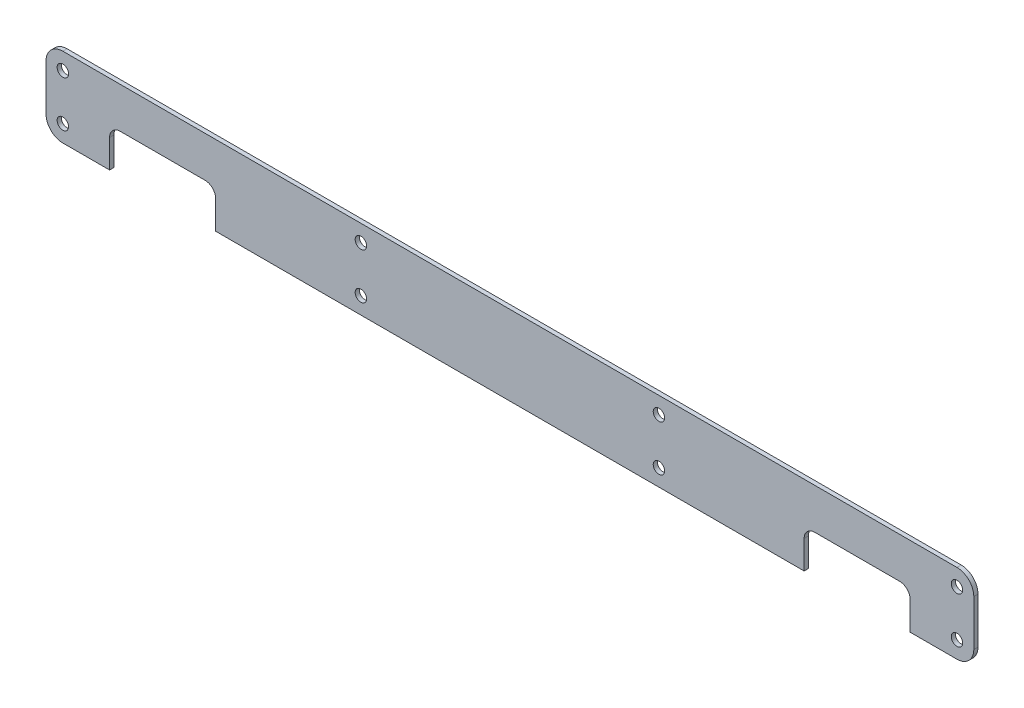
ISO-10303-21;
HEADER;
FILE_DESCRIPTION(('STEP AP214'),'2;1');
FILE_NAME('part.step','',(''),(''),'','','');
FILE_SCHEMA(('AUTOMOTIVE_DESIGN { 1 0 10303 214 1 1 1 1 }'));
ENDSEC;
DATA;
#1=APPLICATION_CONTEXT('core data for automotive mechanical design processes');
#2=APPLICATION_PROTOCOL_DEFINITION('international standard','automotive_design',2000,#1);
#3=PRODUCT_CONTEXT('',#1,'mechanical');
#4=PRODUCT('Part','Part','',(#3));
#5=PRODUCT_RELATED_PRODUCT_CATEGORY('part','',(#4));
#6=PRODUCT_DEFINITION_FORMATION('','',#4);
#7=PRODUCT_DEFINITION_CONTEXT('part definition',#1,'design');
#8=PRODUCT_DEFINITION('design','',#6,#7);
#9=PRODUCT_DEFINITION_SHAPE('','',#8);
#10=(LENGTH_UNIT() NAMED_UNIT(*) SI_UNIT(.MILLI.,.METRE.));
#11=(NAMED_UNIT(*) PLANE_ANGLE_UNIT() SI_UNIT($,.RADIAN.));
#12=(NAMED_UNIT(*) SI_UNIT($,.STERADIAN.) SOLID_ANGLE_UNIT());
#13=UNCERTAINTY_MEASURE_WITH_UNIT(LENGTH_MEASURE(1.E-05),#10,'distance_accuracy_value','');
#14=(GEOMETRIC_REPRESENTATION_CONTEXT(3) GLOBAL_UNCERTAINTY_ASSIGNED_CONTEXT((#13)) GLOBAL_UNIT_ASSIGNED_CONTEXT((#10,
#11,#12)) REPRESENTATION_CONTEXT('',''));
#15=CARTESIAN_POINT('',(0.,0.,0.));
#16=DIRECTION('',(0.,0.,1.));
#17=DIRECTION('',(1.,0.,0.));
#18=AXIS2_PLACEMENT_3D('',#15,#16,#17);
#19=CARTESIAN_POINT('',(0.,0.,-1.5875));
#20=DIRECTION('',(0.,0.,1.));
#21=DIRECTION('',(1.,0.,0.));
#22=AXIS2_PLACEMENT_3D('',#19,#20,#21);
#23=PLANE('',#22);
#24=CARTESIAN_POINT('',(56.2166666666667,23.65,-1.5875));
#25=DIRECTION('',(0.,0.,-1.));
#26=DIRECTION('',(-1.,0.,0.));
#27=AXIS2_PLACEMENT_3D('',#24,#25,#26);
#28=CIRCLE('',#27,2.15);
#29=CARTESIAN_POINT('',(54.0666666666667,23.65,-1.5875));
#30=VERTEX_POINT('',#29);
#31=EDGE_CURVE('E407',#30,#30,#28,.T.);
#32=ORIENTED_EDGE('',*,*,#31,.F.);
#33=EDGE_LOOP('',(#32));
#34=FACE_BOUND('',#33,.T.);
#35=CARTESIAN_POINT('',(-56.2166666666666,23.65,-1.5875));
#36=DIRECTION('',(0.,0.,-1.));
#37=DIRECTION('',(-1.,0.,0.));
#38=AXIS2_PLACEMENT_3D('',#35,#36,#37);
#39=CIRCLE('',#38,2.15);
#40=CARTESIAN_POINT('',(-58.3666666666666,23.65,-1.5875));
#41=VERTEX_POINT('',#40);
#42=EDGE_CURVE('E413',#41,#41,#39,.T.);
#43=ORIENTED_EDGE('',*,*,#42,.F.);
#44=EDGE_LOOP('',(#43));
#45=FACE_BOUND('',#44,.T.);
#46=CARTESIAN_POINT('',(-168.65,23.65,-1.5875));
#47=DIRECTION('',(0.,0.,-1.));
#48=DIRECTION('',(-1.,0.,0.));
#49=AXIS2_PLACEMENT_3D('',#46,#47,#48);
#50=CIRCLE('',#49,2.15000000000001);
#51=CARTESIAN_POINT('',(-170.8,23.65,-1.5875));
#52=VERTEX_POINT('',#51);
#53=EDGE_CURVE('E419',#52,#52,#50,.T.);
#54=ORIENTED_EDGE('',*,*,#53,.F.);
#55=EDGE_LOOP('',(#54));
#56=FACE_BOUND('',#55,.T.);
#57=CARTESIAN_POINT('',(168.65,6.34999999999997,-1.5875));
#58=DIRECTION('',(0.,0.,-1.));
#59=DIRECTION('',(-1.,0.,0.));
#60=AXIS2_PLACEMENT_3D('',#57,#58,#59);
#61=CIRCLE('',#60,2.15000000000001);
#62=CARTESIAN_POINT('',(166.5,6.34999999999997,-1.5875));
#63=VERTEX_POINT('',#62);
#64=EDGE_CURVE('E425',#63,#63,#61,.T.);
#65=ORIENTED_EDGE('',*,*,#64,.F.);
#66=EDGE_LOOP('',(#65));
#67=FACE_BOUND('',#66,.T.);
#68=CARTESIAN_POINT('',(56.2166666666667,6.34999999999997,-1.5875));
#69=DIRECTION('',(0.,0.,-1.));
#70=DIRECTION('',(-1.,0.,0.));
#71=AXIS2_PLACEMENT_3D('',#68,#69,#70);
#72=CIRCLE('',#71,2.15);
#73=CARTESIAN_POINT('',(54.0666666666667,6.34999999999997,-1.5875));
#74=VERTEX_POINT('',#73);
#75=EDGE_CURVE('E431',#74,#74,#72,.T.);
#76=ORIENTED_EDGE('',*,*,#75,.F.);
#77=EDGE_LOOP('',(#76));
#78=FACE_BOUND('',#77,.T.);
#79=CARTESIAN_POINT('',(-56.2166666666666,6.34999999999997,-1.5875));
#80=DIRECTION('',(0.,0.,-1.));
#81=DIRECTION('',(-1.,0.,0.));
#82=AXIS2_PLACEMENT_3D('',#79,#80,#81);
#83=CIRCLE('',#82,2.15);
#84=CARTESIAN_POINT('',(-58.3666666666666,6.34999999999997,-1.5875));
#85=VERTEX_POINT('',#84);
#86=EDGE_CURVE('E437',#85,#85,#83,.T.);
#87=ORIENTED_EDGE('',*,*,#86,.F.);
#88=EDGE_LOOP('',(#87));
#89=FACE_BOUND('',#88,.T.);
#90=CARTESIAN_POINT('',(-168.65,6.34999999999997,-1.5875));
#91=DIRECTION('',(0.,0.,-1.));
#92=DIRECTION('',(-1.,0.,0.));
#93=AXIS2_PLACEMENT_3D('',#90,#91,#92);
#94=CIRCLE('',#93,2.15000000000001);
#95=CARTESIAN_POINT('',(-170.8,6.34999999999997,-1.5875));
#96=VERTEX_POINT('',#95);
#97=EDGE_CURVE('E443',#96,#96,#94,.T.);
#98=ORIENTED_EDGE('',*,*,#97,.F.);
#99=EDGE_LOOP('',(#98));
#100=FACE_BOUND('',#99,.T.);
#101=CARTESIAN_POINT('',(168.65,23.65,-1.5875));
#102=DIRECTION('',(0.,0.,-1.));
#103=DIRECTION('',(-1.,0.,0.));
#104=AXIS2_PLACEMENT_3D('',#101,#102,#103);
#105=CIRCLE('',#104,2.15000000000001);
#106=CARTESIAN_POINT('',(166.5,23.65,-1.5875));
#107=VERTEX_POINT('',#106);
#108=EDGE_CURVE('E400',#107,#107,#105,.T.);
#109=ORIENTED_EDGE('',*,*,#108,.F.);
#110=EDGE_LOOP('',(#109));
#111=FACE_BOUND('',#110,.T.);
#112=DIRECTION('',(-1.,0.,0.));
#113=VECTOR('',#112,1.);
#114=CARTESIAN_POINT('',(-151.,14.65,-1.5875));
#115=LINE('',#114,#113);
#116=CARTESIAN_POINT('',(-115.,14.65,-1.5875));
#117=VERTEX_POINT('',#116);
#118=CARTESIAN_POINT('',(-147.,14.65,-1.5875));
#119=VERTEX_POINT('',#118);
#120=EDGE_CURVE('E293',#117,#119,#115,.T.);
#121=ORIENTED_EDGE('',*,*,#120,.T.);
#122=CARTESIAN_POINT('',(-147.,10.65,-1.5875));
#123=DIRECTION('',(0.,0.,1.));
#124=DIRECTION('',(1.,0.,0.));
#125=AXIS2_PLACEMENT_3D('',#122,#123,#124);
#126=CIRCLE('',#125,4.);
#127=CARTESIAN_POINT('',(-151.,10.65,-1.5875));
#128=VERTEX_POINT('',#127);
#129=EDGE_CURVE('E57',#119,#128,#126,.T.);
#130=ORIENTED_EDGE('',*,*,#129,.T.);
#131=DIRECTION('',(0.,-1.,0.));
#132=VECTOR('',#131,1.);
#133=CARTESIAN_POINT('',(-151.,0.,-1.5875));
#134=LINE('',#133,#132);
#135=CARTESIAN_POINT('',(-151.,0.,-1.5875));
#136=VERTEX_POINT('',#135);
#137=EDGE_CURVE('E300',#128,#136,#134,.T.);
#138=ORIENTED_EDGE('',*,*,#137,.T.);
#139=DIRECTION('',(1.,0.,0.));
#140=VECTOR('',#139,1.);
#141=CARTESIAN_POINT('',(-175.,0.,-1.5875));
#142=LINE('',#141,#140);
#143=CARTESIAN_POINT('',(-168.65,0.,-1.5875));
#144=VERTEX_POINT('',#143);
#145=EDGE_CURVE('E452',#144,#136,#142,.T.);
#146=ORIENTED_EDGE('',*,*,#145,.F.);
#147=CARTESIAN_POINT('',(-168.65,6.34999999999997,-1.5875));
#148=DIRECTION('',(0.,0.,1.));
#149=DIRECTION('',(1.,0.,0.));
#150=AXIS2_PLACEMENT_3D('',#147,#148,#149);
#151=CIRCLE('',#150,6.35);
#152=CARTESIAN_POINT('',(-175.,6.34999999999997,-1.5875));
#153=VERTEX_POINT('',#152);
#154=EDGE_CURVE('E252',#144,#153,#151,.F.);
#155=ORIENTED_EDGE('',*,*,#154,.T.);
#156=DIRECTION('',(0.,-1.,0.));
#157=VECTOR('',#156,1.);
#158=CARTESIAN_POINT('',(-175.,30.,-1.5875));
#159=LINE('',#158,#157);
#160=CARTESIAN_POINT('',(-175.,23.65,-1.5875));
#161=VERTEX_POINT('',#160);
#162=EDGE_CURVE('E225',#161,#153,#159,.T.);
#163=ORIENTED_EDGE('',*,*,#162,.F.);
#164=CARTESIAN_POINT('',(-168.65,23.65,-1.5875));
#165=DIRECTION('',(0.,0.,1.));
#166=DIRECTION('',(1.,0.,0.));
#167=AXIS2_PLACEMENT_3D('',#164,#165,#166);
#168=CIRCLE('',#167,6.35);
#169=CARTESIAN_POINT('',(-168.65,30.,-1.5875));
#170=VERTEX_POINT('',#169);
#171=EDGE_CURVE('E250',#161,#170,#168,.F.);
#172=ORIENTED_EDGE('',*,*,#171,.T.);
#173=DIRECTION('',(-1.,0.,0.));
#174=VECTOR('',#173,1.);
#175=CARTESIAN_POINT('',(-175.,30.,-1.5875));
#176=LINE('',#175,#174);
#177=CARTESIAN_POINT('',(168.65,30.,-1.5875));
#178=VERTEX_POINT('',#177);
#179=EDGE_CURVE('E229',#178,#170,#176,.T.);
#180=ORIENTED_EDGE('',*,*,#179,.F.);
#181=CARTESIAN_POINT('',(168.65,23.65,-1.5875));
#182=DIRECTION('',(0.,0.,1.));
#183=DIRECTION('',(1.,0.,0.));
#184=AXIS2_PLACEMENT_3D('',#181,#182,#183);
#185=CIRCLE('',#184,6.35);
#186=CARTESIAN_POINT('',(175.,23.65,-1.5875));
#187=VERTEX_POINT('',#186);
#188=EDGE_CURVE('E248',#178,#187,#185,.F.);
#189=ORIENTED_EDGE('',*,*,#188,.T.);
#190=DIRECTION('',(0.,1.,0.));
#191=VECTOR('',#190,1.);
#192=CARTESIAN_POINT('',(175.,30.,-1.5875));
#193=LINE('',#192,#191);
#194=CARTESIAN_POINT('',(175.,6.34999999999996,-1.5875));
#195=VERTEX_POINT('',#194);
#196=EDGE_CURVE('E455',#195,#187,#193,.T.);
#197=ORIENTED_EDGE('',*,*,#196,.F.);
#198=CARTESIAN_POINT('',(168.65,6.34999999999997,-1.5875));
#199=DIRECTION('',(0.,0.,1.));
#200=DIRECTION('',(1.,0.,0.));
#201=AXIS2_PLACEMENT_3D('',#198,#199,#200);
#202=CIRCLE('',#201,6.35);
#203=CARTESIAN_POINT('',(168.65,0.,-1.5875));
#204=VERTEX_POINT('',#203);
#205=EDGE_CURVE('E245',#195,#204,#202,.F.);
#206=ORIENTED_EDGE('',*,*,#205,.T.);
#207=CARTESIAN_POINT('',(151.,0.,-1.5875));
#208=VERTEX_POINT('',#207);
#209=EDGE_CURVE('E451',#208,#204,#142,.T.);
#210=ORIENTED_EDGE('',*,*,#209,.F.);
#211=DIRECTION('',(0.,-1.,0.));
#212=VECTOR('',#211,1.);
#213=CARTESIAN_POINT('',(151.,0.,-1.5875));
#214=LINE('',#213,#212);
#215=CARTESIAN_POINT('',(151.,10.65,-1.5875));
#216=VERTEX_POINT('',#215);
#217=EDGE_CURVE('E395',#216,#208,#214,.T.);
#218=ORIENTED_EDGE('',*,*,#217,.F.);
#219=CARTESIAN_POINT('',(147.,10.65,-1.5875));
#220=DIRECTION('',(0.,0.,1.));
#221=DIRECTION('',(1.,0.,0.));
#222=AXIS2_PLACEMENT_3D('',#219,#220,#221);
#223=CIRCLE('',#222,4.);
#224=CARTESIAN_POINT('',(147.,14.65,-1.5875));
#225=VERTEX_POINT('',#224);
#226=EDGE_CURVE('E278',#216,#225,#223,.T.);
#227=ORIENTED_EDGE('',*,*,#226,.T.);
#228=DIRECTION('',(1.,0.,0.));
#229=VECTOR('',#228,1.);
#230=CARTESIAN_POINT('',(151.,14.65,-1.5875));
#231=LINE('',#230,#229);
#232=CARTESIAN_POINT('',(115.,14.65,-1.5875));
#233=VERTEX_POINT('',#232);
#234=EDGE_CURVE('E386',#233,#225,#231,.T.);
#235=ORIENTED_EDGE('',*,*,#234,.F.);
#236=CARTESIAN_POINT('',(115.,10.65,-1.5875));
#237=DIRECTION('',(0.,0.,1.));
#238=DIRECTION('',(1.,0.,0.));
#239=AXIS2_PLACEMENT_3D('',#236,#237,#238);
#240=CIRCLE('',#239,4.);
#241=CARTESIAN_POINT('',(111.,10.65,-1.5875));
#242=VERTEX_POINT('',#241);
#243=EDGE_CURVE('E274',#233,#242,#240,.T.);
#244=ORIENTED_EDGE('',*,*,#243,.T.);
#245=DIRECTION('',(0.,1.,0.));
#246=VECTOR('',#245,1.);
#247=CARTESIAN_POINT('',(111.,0.,-1.5875));
#248=LINE('',#247,#246);
#249=CARTESIAN_POINT('',(111.,0.,-1.5875));
#250=VERTEX_POINT('',#249);
#251=EDGE_CURVE('E390',#250,#242,#248,.T.);
#252=ORIENTED_EDGE('',*,*,#251,.F.);
#253=CARTESIAN_POINT('',(-111.,0.,-1.5875));
#254=VERTEX_POINT('',#253);
#255=EDGE_CURVE('E456',#254,#250,#142,.T.);
#256=ORIENTED_EDGE('',*,*,#255,.F.);
#257=DIRECTION('',(0.,1.,0.));
#258=VECTOR('',#257,1.);
#259=CARTESIAN_POINT('',(-111.,0.,-1.5875));
#260=LINE('',#259,#258);
#261=CARTESIAN_POINT('',(-111.,10.65,-1.5875));
#262=VERTEX_POINT('',#261);
#263=EDGE_CURVE('E191',#254,#262,#260,.T.);
#264=ORIENTED_EDGE('',*,*,#263,.T.);
#265=CARTESIAN_POINT('',(-115.,10.65,-1.5875));
#266=DIRECTION('',(0.,0.,1.));
#267=DIRECTION('',(1.,0.,0.));
#268=AXIS2_PLACEMENT_3D('',#265,#266,#267);
#269=CIRCLE('',#268,4.);
#270=EDGE_CURVE('E290',#262,#117,#269,.T.);
#271=ORIENTED_EDGE('',*,*,#270,.T.);
#272=EDGE_LOOP('',(#121,#130,#138,#146,#155,#163,#172,#180,#189,#197,#206,#210,#218,#227,#235,
#244,#252,#256,#264,#271));
#273=FACE_BOUND('',#272,.T.);
#274=ADVANCED_FACE('F49',(#34,#45,#56,#67,#78,#89,#100,#111,#273),#23,.F.);
#275=CARTESIAN_POINT('',(-175.,0.,-1.5875));
#276=DIRECTION('',(0.,-1.,0.));
#277=DIRECTION('',(1.,0.,0.));
#278=AXIS2_PLACEMENT_3D('',#275,#276,#277);
#279=PLANE('',#278);
#280=ORIENTED_EDGE('',*,*,#145,.T.);
#281=DIRECTION('',(0.,0.,-1.));
#282=VECTOR('',#281,1.);
#283=CARTESIAN_POINT('',(-151.,0.,0.));
#284=LINE('',#283,#282);
#285=CARTESIAN_POINT('',(-151.,0.,0.));
#286=VERTEX_POINT('',#285);
#287=EDGE_CURVE('E195',#286,#136,#284,.T.);
#288=ORIENTED_EDGE('',*,*,#287,.F.);
#289=DIRECTION('',(1.,0.,0.));
#290=VECTOR('',#289,1.);
#291=CARTESIAN_POINT('',(-175.,0.,0.));
#292=LINE('',#291,#290);
#293=CARTESIAN_POINT('',(-168.65,0.,0.));
#294=VERTEX_POINT('',#293);
#295=EDGE_CURVE('E212',#294,#286,#292,.T.);
#296=ORIENTED_EDGE('',*,*,#295,.F.);
#297=DIRECTION('',(0.,0.,1.));
#298=VECTOR('',#297,1.);
#299=CARTESIAN_POINT('',(-168.65,0.,-1.5875));
#300=LINE('',#299,#298);
#301=EDGE_CURVE('E243',#294,#144,#300,.F.);
#302=ORIENTED_EDGE('',*,*,#301,.T.);
#303=EDGE_LOOP('',(#280,#288,#296,#302));
#304=FACE_BOUND('',#303,.T.);
#305=ADVANCED_FACE('F312',(#304),#279,.T.);
#306=CARTESIAN_POINT('',(-111.,0.,0.));
#307=VERTEX_POINT('',#306);
#308=CARTESIAN_POINT('',(111.,0.,0.));
#309=VERTEX_POINT('',#308);
#310=EDGE_CURVE('E201',#307,#309,#292,.T.);
#311=ORIENTED_EDGE('',*,*,#310,.F.);
#312=DIRECTION('',(0.,0.,-1.));
#313=VECTOR('',#312,1.);
#314=CARTESIAN_POINT('',(-111.,0.,0.));
#315=LINE('',#314,#313);
#316=EDGE_CURVE('E184',#307,#254,#315,.T.);
#317=ORIENTED_EDGE('',*,*,#316,.T.);
#318=ORIENTED_EDGE('',*,*,#255,.T.);
#319=DIRECTION('',(0.,0.,-1.));
#320=VECTOR('',#319,1.);
#321=CARTESIAN_POINT('',(111.,0.,0.));
#322=LINE('',#321,#320);
#323=EDGE_CURVE('E211',#309,#250,#322,.T.);
#324=ORIENTED_EDGE('',*,*,#323,.F.);
#325=EDGE_LOOP('',(#311,#317,#318,#324));
#326=FACE_BOUND('',#325,.T.);
#327=ADVANCED_FACE('F209',(#326),#279,.T.);
#328=CARTESIAN_POINT('',(0.,0.,0.));
#329=DIRECTION('',(0.,0.,1.));
#330=DIRECTION('',(1.,0.,0.));
#331=AXIS2_PLACEMENT_3D('',#328,#329,#330);
#332=PLANE('',#331);
#333=CARTESIAN_POINT('',(168.65,23.65,0.));
#334=DIRECTION('',(0.,0.,1.));
#335=DIRECTION('',(1.,0.,0.));
#336=AXIS2_PLACEMENT_3D('',#333,#334,#335);
#337=CIRCLE('',#336,2.15000000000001);
#338=CARTESIAN_POINT('',(170.8,23.65,0.));
#339=VERTEX_POINT('',#338);
#340=EDGE_CURVE('E404',#339,#339,#337,.T.);
#341=ORIENTED_EDGE('',*,*,#340,.F.);
#342=EDGE_LOOP('',(#341));
#343=FACE_BOUND('',#342,.T.);
#344=CARTESIAN_POINT('',(56.2166666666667,23.65,0.));
#345=DIRECTION('',(0.,0.,1.));
#346=DIRECTION('',(1.,0.,0.));
#347=AXIS2_PLACEMENT_3D('',#344,#345,#346);
#348=CIRCLE('',#347,2.15);
#349=CARTESIAN_POINT('',(58.3666666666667,23.65,0.));
#350=VERTEX_POINT('',#349);
#351=EDGE_CURVE('E410',#350,#350,#348,.T.);
#352=ORIENTED_EDGE('',*,*,#351,.F.);
#353=EDGE_LOOP('',(#352));
#354=FACE_BOUND('',#353,.T.);
#355=CARTESIAN_POINT('',(-56.2166666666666,23.65,0.));
#356=DIRECTION('',(0.,0.,1.));
#357=DIRECTION('',(1.,0.,0.));
#358=AXIS2_PLACEMENT_3D('',#355,#356,#357);
#359=CIRCLE('',#358,2.15);
#360=CARTESIAN_POINT('',(-54.0666666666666,23.65,0.));
#361=VERTEX_POINT('',#360);
#362=EDGE_CURVE('E416',#361,#361,#359,.T.);
#363=ORIENTED_EDGE('',*,*,#362,.F.);
#364=EDGE_LOOP('',(#363));
#365=FACE_BOUND('',#364,.T.);
#366=CARTESIAN_POINT('',(-168.65,23.65,0.));
#367=DIRECTION('',(0.,0.,1.));
#368=DIRECTION('',(1.,0.,0.));
#369=AXIS2_PLACEMENT_3D('',#366,#367,#368);
#370=CIRCLE('',#369,2.15000000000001);
#371=CARTESIAN_POINT('',(-166.5,23.65,0.));
#372=VERTEX_POINT('',#371);
#373=EDGE_CURVE('E422',#372,#372,#370,.T.);
#374=ORIENTED_EDGE('',*,*,#373,.F.);
#375=EDGE_LOOP('',(#374));
#376=FACE_BOUND('',#375,.T.);
#377=CARTESIAN_POINT('',(168.65,6.34999999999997,0.));
#378=DIRECTION('',(0.,0.,1.));
#379=DIRECTION('',(1.,0.,0.));
#380=AXIS2_PLACEMENT_3D('',#377,#378,#379);
#381=CIRCLE('',#380,2.15000000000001);
#382=CARTESIAN_POINT('',(170.8,6.34999999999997,0.));
#383=VERTEX_POINT('',#382);
#384=EDGE_CURVE('E428',#383,#383,#381,.T.);
#385=ORIENTED_EDGE('',*,*,#384,.F.);
#386=EDGE_LOOP('',(#385));
#387=FACE_BOUND('',#386,.T.);
#388=CARTESIAN_POINT('',(56.2166666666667,6.34999999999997,0.));
#389=DIRECTION('',(0.,0.,1.));
#390=DIRECTION('',(1.,0.,0.));
#391=AXIS2_PLACEMENT_3D('',#388,#389,#390);
#392=CIRCLE('',#391,2.15);
#393=CARTESIAN_POINT('',(58.3666666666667,6.34999999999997,0.));
#394=VERTEX_POINT('',#393);
#395=EDGE_CURVE('E434',#394,#394,#392,.T.);
#396=ORIENTED_EDGE('',*,*,#395,.F.);
#397=EDGE_LOOP('',(#396));
#398=FACE_BOUND('',#397,.T.);
#399=CARTESIAN_POINT('',(-56.2166666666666,6.34999999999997,0.));
#400=DIRECTION('',(0.,0.,1.));
#401=DIRECTION('',(1.,0.,0.));
#402=AXIS2_PLACEMENT_3D('',#399,#400,#401);
#403=CIRCLE('',#402,2.15);
#404=CARTESIAN_POINT('',(-54.0666666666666,6.34999999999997,0.));
#405=VERTEX_POINT('',#404);
#406=EDGE_CURVE('E440',#405,#405,#403,.T.);
#407=ORIENTED_EDGE('',*,*,#406,.F.);
#408=EDGE_LOOP('',(#407));
#409=FACE_BOUND('',#408,.T.);
#410=CARTESIAN_POINT('',(-168.65,6.34999999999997,0.));
#411=DIRECTION('',(0.,0.,1.));
#412=DIRECTION('',(1.,0.,0.));
#413=AXIS2_PLACEMENT_3D('',#410,#411,#412);
#414=CIRCLE('',#413,2.15000000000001);
#415=CARTESIAN_POINT('',(-166.5,6.34999999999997,0.));
#416=VERTEX_POINT('',#415);
#417=EDGE_CURVE('E446',#416,#416,#414,.T.);
#418=ORIENTED_EDGE('',*,*,#417,.F.);
#419=EDGE_LOOP('',(#418));
#420=FACE_BOUND('',#419,.T.);
#421=ORIENTED_EDGE('',*,*,#295,.T.);
#422=DIRECTION('',(0.,-1.,0.));
#423=VECTOR('',#422,1.);
#424=CARTESIAN_POINT('',(-151.,0.,0.));
#425=LINE('',#424,#423);
#426=CARTESIAN_POINT('',(-151.,10.65,0.));
#427=VERTEX_POINT('',#426);
#428=EDGE_CURVE('E477',#427,#286,#425,.T.);
#429=ORIENTED_EDGE('',*,*,#428,.F.);
#430=CARTESIAN_POINT('',(-147.,10.65,0.));
#431=DIRECTION('',(0.,0.,1.));
#432=DIRECTION('',(1.,0.,0.));
#433=AXIS2_PLACEMENT_3D('',#430,#431,#432);
#434=CIRCLE('',#433,4.);
#435=CARTESIAN_POINT('',(-147.,14.65,0.));
#436=VERTEX_POINT('',#435);
#437=EDGE_CURVE('E11',#427,#436,#434,.F.);
#438=ORIENTED_EDGE('',*,*,#437,.T.);
#439=DIRECTION('',(-1.,0.,0.));
#440=VECTOR('',#439,1.);
#441=CARTESIAN_POINT('',(-151.,14.65,0.));
#442=LINE('',#441,#440);
#443=CARTESIAN_POINT('',(-115.,14.65,0.));
#444=VERTEX_POINT('',#443);
#445=EDGE_CURVE('E206',#444,#436,#442,.T.);
#446=ORIENTED_EDGE('',*,*,#445,.F.);
#447=CARTESIAN_POINT('',(-115.,10.65,0.));
#448=DIRECTION('',(0.,0.,1.));
#449=DIRECTION('',(1.,0.,0.));
#450=AXIS2_PLACEMENT_3D('',#447,#448,#449);
#451=CIRCLE('',#450,4.);
#452=CARTESIAN_POINT('',(-111.,10.65,0.));
#453=VERTEX_POINT('',#452);
#454=EDGE_CURVE('E205',#444,#453,#451,.F.);
#455=ORIENTED_EDGE('',*,*,#454,.T.);
#456=DIRECTION('',(0.,1.,0.));
#457=VECTOR('',#456,1.);
#458=CARTESIAN_POINT('',(-111.,0.,0.));
#459=LINE('',#458,#457);
#460=EDGE_CURVE('E188',#307,#453,#459,.T.);
#461=ORIENTED_EDGE('',*,*,#460,.F.);
#462=ORIENTED_EDGE('',*,*,#310,.T.);
#463=DIRECTION('',(0.,1.,0.));
#464=VECTOR('',#463,1.);
#465=CARTESIAN_POINT('',(111.,0.,0.));
#466=LINE('',#465,#464);
#467=CARTESIAN_POINT('',(111.,10.65,0.));
#468=VERTEX_POINT('',#467);
#469=EDGE_CURVE('E385',#309,#468,#466,.T.);
#470=ORIENTED_EDGE('',*,*,#469,.T.);
#471=CARTESIAN_POINT('',(115.,10.65,0.));
#472=DIRECTION('',(0.,0.,1.));
#473=DIRECTION('',(1.,0.,0.));
#474=AXIS2_PLACEMENT_3D('',#471,#472,#473);
#475=CIRCLE('',#474,4.);
#476=CARTESIAN_POINT('',(115.,14.65,0.));
#477=VERTEX_POINT('',#476);
#478=EDGE_CURVE('E276',#468,#477,#475,.F.);
#479=ORIENTED_EDGE('',*,*,#478,.T.);
#480=DIRECTION('',(1.,0.,0.));
#481=VECTOR('',#480,1.);
#482=CARTESIAN_POINT('',(151.,14.65,0.));
#483=LINE('',#482,#481);
#484=CARTESIAN_POINT('',(147.,14.65,0.));
#485=VERTEX_POINT('',#484);
#486=EDGE_CURVE('E378',#477,#485,#483,.T.);
#487=ORIENTED_EDGE('',*,*,#486,.T.);
#488=CARTESIAN_POINT('',(147.,10.65,0.));
#489=DIRECTION('',(0.,0.,1.));
#490=DIRECTION('',(1.,0.,0.));
#491=AXIS2_PLACEMENT_3D('',#488,#489,#490);
#492=CIRCLE('',#491,4.);
#493=CARTESIAN_POINT('',(151.,10.65,0.));
#494=VERTEX_POINT('',#493);
#495=EDGE_CURVE('E280',#485,#494,#492,.F.);
#496=ORIENTED_EDGE('',*,*,#495,.T.);
#497=DIRECTION('',(0.,-1.,0.));
#498=VECTOR('',#497,1.);
#499=CARTESIAN_POINT('',(151.,0.,0.));
#500=LINE('',#499,#498);
#501=CARTESIAN_POINT('',(151.,0.,0.));
#502=VERTEX_POINT('',#501);
#503=EDGE_CURVE('E375',#494,#502,#500,.T.);
#504=ORIENTED_EDGE('',*,*,#503,.T.);
#505=CARTESIAN_POINT('',(168.65,0.,0.));
#506=VERTEX_POINT('',#505);
#507=EDGE_CURVE('E213',#502,#506,#292,.T.);
#508=ORIENTED_EDGE('',*,*,#507,.T.);
#509=CARTESIAN_POINT('',(168.65,6.34999999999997,0.));
#510=DIRECTION('',(0.,0.,1.));
#511=DIRECTION('',(1.,0.,0.));
#512=AXIS2_PLACEMENT_3D('',#509,#510,#511);
#513=CIRCLE('',#512,6.35);
#514=CARTESIAN_POINT('',(175.,6.34999999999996,0.));
#515=VERTEX_POINT('',#514);
#516=EDGE_CURVE('E232',#506,#515,#513,.T.);
#517=ORIENTED_EDGE('',*,*,#516,.T.);
#518=DIRECTION('',(0.,1.,0.));
#519=VECTOR('',#518,1.);
#520=CARTESIAN_POINT('',(175.,30.,0.));
#521=LINE('',#520,#519);
#522=CARTESIAN_POINT('',(175.,23.65,0.));
#523=VERTEX_POINT('',#522);
#524=EDGE_CURVE('E215',#515,#523,#521,.T.);
#525=ORIENTED_EDGE('',*,*,#524,.T.);
#526=CARTESIAN_POINT('',(168.65,23.65,0.));
#527=DIRECTION('',(0.,0.,1.));
#528=DIRECTION('',(1.,0.,0.));
#529=AXIS2_PLACEMENT_3D('',#526,#527,#528);
#530=CIRCLE('',#529,6.35);
#531=CARTESIAN_POINT('',(168.65,30.,0.));
#532=VERTEX_POINT('',#531);
#533=EDGE_CURVE('E234',#523,#532,#530,.T.);
#534=ORIENTED_EDGE('',*,*,#533,.T.);
#535=DIRECTION('',(-1.,0.,0.));
#536=VECTOR('',#535,1.);
#537=CARTESIAN_POINT('',(-175.,30.,0.));
#538=LINE('',#537,#536);
#539=CARTESIAN_POINT('',(-168.65,30.,0.));
#540=VERTEX_POINT('',#539);
#541=EDGE_CURVE('E222',#532,#540,#538,.T.);
#542=ORIENTED_EDGE('',*,*,#541,.T.);
#543=CARTESIAN_POINT('',(-168.65,23.65,0.));
#544=DIRECTION('',(0.,0.,1.));
#545=DIRECTION('',(1.,0.,0.));
#546=AXIS2_PLACEMENT_3D('',#543,#544,#545);
#547=CIRCLE('',#546,6.35);
#548=CARTESIAN_POINT('',(-175.,23.65,0.));
#549=VERTEX_POINT('',#548);
#550=EDGE_CURVE('E236',#540,#549,#547,.T.);
#551=ORIENTED_EDGE('',*,*,#550,.T.);
#552=DIRECTION('',(0.,-1.,0.));
#553=VECTOR('',#552,1.);
#554=CARTESIAN_POINT('',(-175.,30.,0.));
#555=LINE('',#554,#553);
#556=CARTESIAN_POINT('',(-175.,6.34999999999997,0.));
#557=VERTEX_POINT('',#556);
#558=EDGE_CURVE('E216',#549,#557,#555,.T.);
#559=ORIENTED_EDGE('',*,*,#558,.T.);
#560=CARTESIAN_POINT('',(-168.65,6.34999999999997,0.));
#561=DIRECTION('',(0.,0.,1.));
#562=DIRECTION('',(1.,0.,0.));
#563=AXIS2_PLACEMENT_3D('',#560,#561,#562);
#564=CIRCLE('',#563,6.35);
#565=EDGE_CURVE('E238',#557,#294,#564,.T.);
#566=ORIENTED_EDGE('',*,*,#565,.T.);
#567=EDGE_LOOP('',(#421,#429,#438,#446,#455,#461,#462,#470,#479,#487,#496,#504,#508,#517,#525,
#534,#542,#551,#559,#566));
#568=FACE_BOUND('',#567,.T.);
#569=ADVANCED_FACE('F199',(#343,#354,#365,#376,#387,#398,#409,#420,#568),#332,.T.);
#570=DIRECTION('',(0.,0.,-1.));
#571=VECTOR('',#570,1.);
#572=CARTESIAN_POINT('',(151.,0.,0.));
#573=LINE('',#572,#571);
#574=EDGE_CURVE('E383',#502,#208,#573,.T.);
#575=ORIENTED_EDGE('',*,*,#574,.T.);
#576=ORIENTED_EDGE('',*,*,#209,.T.);
#577=DIRECTION('',(0.,0.,1.));
#578=VECTOR('',#577,1.);
#579=CARTESIAN_POINT('',(168.65,0.,-1.5875));
#580=LINE('',#579,#578);
#581=EDGE_CURVE('E240',#204,#506,#580,.T.);
#582=ORIENTED_EDGE('',*,*,#581,.T.);
#583=ORIENTED_EDGE('',*,*,#507,.F.);
#584=EDGE_LOOP('',(#575,#576,#582,#583));
#585=FACE_BOUND('',#584,.T.);
#586=ADVANCED_FACE('F321',(#585),#279,.T.);
#587=CARTESIAN_POINT('',(-175.,30.,-1.5875));
#588=DIRECTION('',(-1.,0.,0.));
#589=DIRECTION('',(0.,0.,1.));
#590=AXIS2_PLACEMENT_3D('',#587,#588,#589);
#591=PLANE('',#590);
#592=ORIENTED_EDGE('',*,*,#162,.T.);
#593=DIRECTION('',(0.,0.,1.));
#594=VECTOR('',#593,1.);
#595=CARTESIAN_POINT('',(-175.,6.34999999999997,-1.5875));
#596=LINE('',#595,#594);
#597=EDGE_CURVE('E228',#153,#557,#596,.T.);
#598=ORIENTED_EDGE('',*,*,#597,.T.);
#599=ORIENTED_EDGE('',*,*,#558,.F.);
#600=DIRECTION('',(0.,0.,1.));
#601=VECTOR('',#600,1.);
#602=CARTESIAN_POINT('',(-175.,23.65,-1.5875));
#603=LINE('',#602,#601);
#604=EDGE_CURVE('E226',#549,#161,#603,.F.);
#605=ORIENTED_EDGE('',*,*,#604,.T.);
#606=EDGE_LOOP('',(#592,#598,#599,#605));
#607=FACE_BOUND('',#606,.T.);
#608=ADVANCED_FACE('F335',(#607),#591,.T.);
#609=CARTESIAN_POINT('',(-175.,30.,-1.5875));
#610=DIRECTION('',(0.,1.,0.));
#611=DIRECTION('',(0.,0.,1.));
#612=AXIS2_PLACEMENT_3D('',#609,#610,#611);
#613=PLANE('',#612);
#614=ORIENTED_EDGE('',*,*,#179,.T.);
#615=DIRECTION('',(0.,0.,1.));
#616=VECTOR('',#615,1.);
#617=CARTESIAN_POINT('',(-168.65,30.,-1.5875));
#618=LINE('',#617,#616);
#619=EDGE_CURVE('E256',#170,#540,#618,.T.);
#620=ORIENTED_EDGE('',*,*,#619,.T.);
#621=ORIENTED_EDGE('',*,*,#541,.F.);
#622=DIRECTION('',(0.,0.,1.));
#623=VECTOR('',#622,1.);
#624=CARTESIAN_POINT('',(168.65,30.,-1.5875));
#625=LINE('',#624,#623);
#626=EDGE_CURVE('E254',#532,#178,#625,.F.);
#627=ORIENTED_EDGE('',*,*,#626,.T.);
#628=EDGE_LOOP('',(#614,#620,#621,#627));
#629=FACE_BOUND('',#628,.T.);
#630=ADVANCED_FACE('F331',(#629),#613,.T.);
#631=CARTESIAN_POINT('',(175.,30.,-1.5875));
#632=DIRECTION('',(1.,0.,0.));
#633=DIRECTION('',(0.,1.,0.));
#634=AXIS2_PLACEMENT_3D('',#631,#632,#633);
#635=PLANE('',#634);
#636=ORIENTED_EDGE('',*,*,#196,.T.);
#637=DIRECTION('',(0.,0.,1.));
#638=VECTOR('',#637,1.);
#639=CARTESIAN_POINT('',(175.,23.65,-1.5875));
#640=LINE('',#639,#638);
#641=EDGE_CURVE('E261',#187,#523,#640,.T.);
#642=ORIENTED_EDGE('',*,*,#641,.T.);
#643=ORIENTED_EDGE('',*,*,#524,.F.);
#644=DIRECTION('',(0.,0.,1.));
#645=VECTOR('',#644,1.);
#646=CARTESIAN_POINT('',(175.,6.34999999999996,-1.5875));
#647=LINE('',#646,#645);
#648=EDGE_CURVE('E259',#515,#195,#647,.F.);
#649=ORIENTED_EDGE('',*,*,#648,.T.);
#650=EDGE_LOOP('',(#636,#642,#643,#649));
#651=FACE_BOUND('',#650,.T.);
#652=ADVANCED_FACE('F334',(#651),#635,.T.);
#653=CARTESIAN_POINT('',(-168.65,6.34999999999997,-1.5875));
#654=DIRECTION('',(0.,0.,1.));
#655=DIRECTION('',(1.,0.,0.));
#656=AXIS2_PLACEMENT_3D('',#653,#654,#655);
#657=CYLINDRICAL_SURFACE('',#656,6.35);
#658=ORIENTED_EDGE('',*,*,#154,.F.);
#659=ORIENTED_EDGE('',*,*,#301,.F.);
#660=ORIENTED_EDGE('',*,*,#565,.F.);
#661=ORIENTED_EDGE('',*,*,#597,.F.);
#662=EDGE_LOOP('',(#658,#659,#660,#661));
#663=FACE_BOUND('',#662,.T.);
#664=ADVANCED_FACE('F338',(#663),#657,.T.);
#665=CARTESIAN_POINT('',(-168.65,23.65,-1.5875));
#666=DIRECTION('',(0.,0.,1.));
#667=DIRECTION('',(1.,0.,0.));
#668=AXIS2_PLACEMENT_3D('',#665,#666,#667);
#669=CYLINDRICAL_SURFACE('',#668,6.35);
#670=ORIENTED_EDGE('',*,*,#171,.F.);
#671=ORIENTED_EDGE('',*,*,#604,.F.);
#672=ORIENTED_EDGE('',*,*,#550,.F.);
#673=ORIENTED_EDGE('',*,*,#619,.F.);
#674=EDGE_LOOP('',(#670,#671,#672,#673));
#675=FACE_BOUND('',#674,.T.);
#676=ADVANCED_FACE('F346',(#675),#669,.T.);
#677=CARTESIAN_POINT('',(168.65,23.65,-1.5875));
#678=DIRECTION('',(0.,0.,1.));
#679=DIRECTION('',(1.,0.,0.));
#680=AXIS2_PLACEMENT_3D('',#677,#678,#679);
#681=CYLINDRICAL_SURFACE('',#680,6.35);
#682=ORIENTED_EDGE('',*,*,#188,.F.);
#683=ORIENTED_EDGE('',*,*,#626,.F.);
#684=ORIENTED_EDGE('',*,*,#533,.F.);
#685=ORIENTED_EDGE('',*,*,#641,.F.);
#686=EDGE_LOOP('',(#682,#683,#684,#685));
#687=FACE_BOUND('',#686,.T.);
#688=ADVANCED_FACE('F350',(#687),#681,.T.);
#689=CARTESIAN_POINT('',(168.65,6.34999999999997,-1.5875));
#690=DIRECTION('',(0.,0.,1.));
#691=DIRECTION('',(1.,0.,0.));
#692=AXIS2_PLACEMENT_3D('',#689,#690,#691);
#693=CYLINDRICAL_SURFACE('',#692,6.35);
#694=ORIENTED_EDGE('',*,*,#205,.F.);
#695=ORIENTED_EDGE('',*,*,#648,.F.);
#696=ORIENTED_EDGE('',*,*,#516,.F.);
#697=ORIENTED_EDGE('',*,*,#581,.F.);
#698=EDGE_LOOP('',(#694,#695,#696,#697));
#699=FACE_BOUND('',#698,.T.);
#700=ADVANCED_FACE('F354',(#699),#693,.T.);
#701=CARTESIAN_POINT('',(-168.65,6.34999999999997,-1.5875));
#702=DIRECTION('',(0.,0.,-1.));
#703=DIRECTION('',(-1.,0.,0.));
#704=AXIS2_PLACEMENT_3D('',#701,#702,#703);
#705=CYLINDRICAL_SURFACE('',#704,2.15000000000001);
#706=ORIENTED_EDGE('',*,*,#97,.T.);
#707=EDGE_LOOP('',(#706));
#708=FACE_BOUND('',#707,.T.);
#709=ORIENTED_EDGE('',*,*,#417,.T.);
#710=EDGE_LOOP('',(#709));
#711=FACE_BOUND('',#710,.T.);
#712=ADVANCED_FACE('F326',(#708,#711),#705,.F.);
#713=CARTESIAN_POINT('',(-56.2166666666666,6.34999999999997,-1.5875));
#714=DIRECTION('',(0.,0.,-1.));
#715=DIRECTION('',(-1.,0.,0.));
#716=AXIS2_PLACEMENT_3D('',#713,#714,#715);
#717=CYLINDRICAL_SURFACE('',#716,2.15);
#718=ORIENTED_EDGE('',*,*,#86,.T.);
#719=EDGE_LOOP('',(#718));
#720=FACE_BOUND('',#719,.T.);
#721=ORIENTED_EDGE('',*,*,#406,.T.);
#722=EDGE_LOOP('',(#721));
#723=FACE_BOUND('',#722,.T.);
#724=ADVANCED_FACE('F530',(#720,#723),#717,.F.);
#725=CARTESIAN_POINT('',(56.2166666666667,6.34999999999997,-1.5875));
#726=DIRECTION('',(0.,0.,-1.));
#727=DIRECTION('',(-1.,0.,0.));
#728=AXIS2_PLACEMENT_3D('',#725,#726,#727);
#729=CYLINDRICAL_SURFACE('',#728,2.15);
#730=ORIENTED_EDGE('',*,*,#75,.T.);
#731=EDGE_LOOP('',(#730));
#732=FACE_BOUND('',#731,.T.);
#733=ORIENTED_EDGE('',*,*,#395,.T.);
#734=EDGE_LOOP('',(#733));
#735=FACE_BOUND('',#734,.T.);
#736=ADVANCED_FACE('F527',(#732,#735),#729,.F.);
#737=CARTESIAN_POINT('',(168.65,6.34999999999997,-1.5875));
#738=DIRECTION('',(0.,0.,-1.));
#739=DIRECTION('',(-1.,0.,0.));
#740=AXIS2_PLACEMENT_3D('',#737,#738,#739);
#741=CYLINDRICAL_SURFACE('',#740,2.15000000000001);
#742=ORIENTED_EDGE('',*,*,#64,.T.);
#743=EDGE_LOOP('',(#742));
#744=FACE_BOUND('',#743,.T.);
#745=ORIENTED_EDGE('',*,*,#384,.T.);
#746=EDGE_LOOP('',(#745));
#747=FACE_BOUND('',#746,.T.);
#748=ADVANCED_FACE('F523',(#744,#747),#741,.F.);
#749=CARTESIAN_POINT('',(-168.65,23.65,-1.5875));
#750=DIRECTION('',(0.,0.,-1.));
#751=DIRECTION('',(-1.,0.,0.));
#752=AXIS2_PLACEMENT_3D('',#749,#750,#751);
#753=CYLINDRICAL_SURFACE('',#752,2.15000000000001);
#754=ORIENTED_EDGE('',*,*,#53,.T.);
#755=EDGE_LOOP('',(#754));
#756=FACE_BOUND('',#755,.T.);
#757=ORIENTED_EDGE('',*,*,#373,.T.);
#758=EDGE_LOOP('',(#757));
#759=FACE_BOUND('',#758,.T.);
#760=ADVANCED_FACE('F519',(#756,#759),#753,.F.);
#761=CARTESIAN_POINT('',(-56.2166666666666,23.65,-1.5875));
#762=DIRECTION('',(0.,0.,-1.));
#763=DIRECTION('',(-1.,0.,0.));
#764=AXIS2_PLACEMENT_3D('',#761,#762,#763);
#765=CYLINDRICAL_SURFACE('',#764,2.15);
#766=ORIENTED_EDGE('',*,*,#42,.T.);
#767=EDGE_LOOP('',(#766));
#768=FACE_BOUND('',#767,.T.);
#769=ORIENTED_EDGE('',*,*,#362,.T.);
#770=EDGE_LOOP('',(#769));
#771=FACE_BOUND('',#770,.T.);
#772=ADVANCED_FACE('F515',(#768,#771),#765,.F.);
#773=CARTESIAN_POINT('',(56.2166666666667,23.65,-1.5875));
#774=DIRECTION('',(0.,0.,-1.));
#775=DIRECTION('',(-1.,0.,0.));
#776=AXIS2_PLACEMENT_3D('',#773,#774,#775);
#777=CYLINDRICAL_SURFACE('',#776,2.15);
#778=ORIENTED_EDGE('',*,*,#31,.T.);
#779=EDGE_LOOP('',(#778));
#780=FACE_BOUND('',#779,.T.);
#781=ORIENTED_EDGE('',*,*,#351,.T.);
#782=EDGE_LOOP('',(#781));
#783=FACE_BOUND('',#782,.T.);
#784=ADVANCED_FACE('F511',(#780,#783),#777,.F.);
#785=CARTESIAN_POINT('',(168.65,23.65,-1.5875));
#786=DIRECTION('',(0.,0.,-1.));
#787=DIRECTION('',(-1.,0.,0.));
#788=AXIS2_PLACEMENT_3D('',#785,#786,#787);
#789=CYLINDRICAL_SURFACE('',#788,2.15000000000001);
#790=ORIENTED_EDGE('',*,*,#108,.T.);
#791=EDGE_LOOP('',(#790));
#792=FACE_BOUND('',#791,.T.);
#793=ORIENTED_EDGE('',*,*,#340,.T.);
#794=EDGE_LOOP('',(#793));
#795=FACE_BOUND('',#794,.T.);
#796=ADVANCED_FACE('F506',(#792,#795),#789,.F.);
#797=CARTESIAN_POINT('',(151.,0.,0.));
#798=DIRECTION('',(1.,0.,0.));
#799=DIRECTION('',(0.,1.,0.));
#800=AXIS2_PLACEMENT_3D('',#797,#798,#799);
#801=PLANE('',#800);
#802=ORIENTED_EDGE('',*,*,#503,.F.);
#803=DIRECTION('',(0.,0.,-1.));
#804=VECTOR('',#803,1.);
#805=CARTESIAN_POINT('',(151.,10.65,-1.5875));
#806=LINE('',#805,#804);
#807=EDGE_CURVE('E271',#494,#216,#806,.T.);
#808=ORIENTED_EDGE('',*,*,#807,.T.);
#809=ORIENTED_EDGE('',*,*,#217,.T.);
#810=ORIENTED_EDGE('',*,*,#574,.F.);
#811=EDGE_LOOP('',(#802,#808,#809,#810));
#812=FACE_BOUND('',#811,.T.);
#813=ADVANCED_FACE('F380',(#812),#801,.F.);
#814=CARTESIAN_POINT('',(151.,14.65,0.));
#815=DIRECTION('',(0.,1.,0.));
#816=DIRECTION('',(0.,0.,1.));
#817=AXIS2_PLACEMENT_3D('',#814,#815,#816);
#818=PLANE('',#817);
#819=ORIENTED_EDGE('',*,*,#486,.F.);
#820=DIRECTION('',(0.,0.,-1.));
#821=VECTOR('',#820,1.);
#822=CARTESIAN_POINT('',(115.,14.65,-1.5875));
#823=LINE('',#822,#821);
#824=EDGE_CURVE('E266',#477,#233,#823,.T.);
#825=ORIENTED_EDGE('',*,*,#824,.T.);
#826=ORIENTED_EDGE('',*,*,#234,.T.);
#827=DIRECTION('',(0.,0.,-1.));
#828=VECTOR('',#827,1.);
#829=CARTESIAN_POINT('',(147.,14.65,0.));
#830=LINE('',#829,#828);
#831=EDGE_CURVE('E264',#225,#485,#830,.F.);
#832=ORIENTED_EDGE('',*,*,#831,.T.);
#833=EDGE_LOOP('',(#819,#825,#826,#832));
#834=FACE_BOUND('',#833,.T.);
#835=ADVANCED_FACE('F498',(#834),#818,.F.);
#836=CARTESIAN_POINT('',(111.,0.,0.));
#837=DIRECTION('',(-1.,0.,0.));
#838=DIRECTION('',(0.,-1.,0.));
#839=AXIS2_PLACEMENT_3D('',#836,#837,#838);
#840=PLANE('',#839);
#841=ORIENTED_EDGE('',*,*,#251,.T.);
#842=DIRECTION('',(0.,0.,-1.));
#843=VECTOR('',#842,1.);
#844=CARTESIAN_POINT('',(111.,10.65,0.));
#845=LINE('',#844,#843);
#846=EDGE_CURVE('E269',#242,#468,#845,.F.);
#847=ORIENTED_EDGE('',*,*,#846,.T.);
#848=ORIENTED_EDGE('',*,*,#469,.F.);
#849=ORIENTED_EDGE('',*,*,#323,.T.);
#850=EDGE_LOOP('',(#841,#847,#848,#849));
#851=FACE_BOUND('',#850,.T.);
#852=ADVANCED_FACE('F362',(#851),#840,.F.);
#853=CARTESIAN_POINT('',(115.,10.65,0.));
#854=DIRECTION('',(0.,0.,1.));
#855=DIRECTION('',(1.,0.,0.));
#856=AXIS2_PLACEMENT_3D('',#853,#854,#855);
#857=CYLINDRICAL_SURFACE('',#856,4.);
#858=ORIENTED_EDGE('',*,*,#478,.F.);
#859=ORIENTED_EDGE('',*,*,#846,.F.);
#860=ORIENTED_EDGE('',*,*,#243,.F.);
#861=ORIENTED_EDGE('',*,*,#824,.F.);
#862=EDGE_LOOP('',(#858,#859,#860,#861));
#863=FACE_BOUND('',#862,.T.);
#864=ADVANCED_FACE('F359',(#863),#857,.F.);
#865=CARTESIAN_POINT('',(147.,10.65,0.));
#866=DIRECTION('',(0.,0.,1.));
#867=DIRECTION('',(1.,0.,0.));
#868=AXIS2_PLACEMENT_3D('',#865,#866,#867);
#869=CYLINDRICAL_SURFACE('',#868,4.);
#870=ORIENTED_EDGE('',*,*,#495,.F.);
#871=ORIENTED_EDGE('',*,*,#831,.F.);
#872=ORIENTED_EDGE('',*,*,#226,.F.);
#873=ORIENTED_EDGE('',*,*,#807,.F.);
#874=EDGE_LOOP('',(#870,#871,#872,#873));
#875=FACE_BOUND('',#874,.T.);
#876=ADVANCED_FACE('F361',(#875),#869,.F.);
#877=CARTESIAN_POINT('',(-151.,0.,0.));
#878=DIRECTION('',(1.,0.,0.));
#879=DIRECTION('',(0.,1.,0.));
#880=AXIS2_PLACEMENT_3D('',#877,#878,#879);
#881=PLANE('',#880);
#882=ORIENTED_EDGE('',*,*,#137,.F.);
#883=DIRECTION('',(0.,0.,-1.));
#884=VECTOR('',#883,1.);
#885=CARTESIAN_POINT('',(-151.,10.65,0.));
#886=LINE('',#885,#884);
#887=EDGE_CURVE('E64',#128,#427,#886,.F.);
#888=ORIENTED_EDGE('',*,*,#887,.T.);
#889=ORIENTED_EDGE('',*,*,#428,.T.);
#890=ORIENTED_EDGE('',*,*,#287,.T.);
#891=EDGE_LOOP('',(#882,#888,#889,#890));
#892=FACE_BOUND('',#891,.T.);
#893=ADVANCED_FACE('F364',(#892),#881,.T.);
#894=CARTESIAN_POINT('',(-111.,0.,0.));
#895=DIRECTION('',(-1.,0.,0.));
#896=DIRECTION('',(0.,-1.,0.));
#897=AXIS2_PLACEMENT_3D('',#894,#895,#896);
#898=PLANE('',#897);
#899=ORIENTED_EDGE('',*,*,#460,.T.);
#900=DIRECTION('',(0.,0.,-1.));
#901=VECTOR('',#900,1.);
#902=CARTESIAN_POINT('',(-111.,10.65,-1.5875));
#903=LINE('',#902,#901);
#904=EDGE_CURVE('E282',#453,#262,#903,.T.);
#905=ORIENTED_EDGE('',*,*,#904,.T.);
#906=ORIENTED_EDGE('',*,*,#263,.F.);
#907=ORIENTED_EDGE('',*,*,#316,.F.);
#908=EDGE_LOOP('',(#899,#905,#906,#907));
#909=FACE_BOUND('',#908,.T.);
#910=ADVANCED_FACE('F186',(#909),#898,.T.);
#911=CARTESIAN_POINT('',(-151.,14.65,0.));
#912=DIRECTION('',(0.,-1.,0.));
#913=DIRECTION('',(0.,0.,-1.));
#914=AXIS2_PLACEMENT_3D('',#911,#912,#913);
#915=PLANE('',#914);
#916=ORIENTED_EDGE('',*,*,#120,.F.);
#917=DIRECTION('',(0.,0.,-1.));
#918=VECTOR('',#917,1.);
#919=CARTESIAN_POINT('',(-115.,14.65,0.));
#920=LINE('',#919,#918);
#921=EDGE_CURVE('E287',#117,#444,#920,.F.);
#922=ORIENTED_EDGE('',*,*,#921,.T.);
#923=ORIENTED_EDGE('',*,*,#445,.T.);
#924=DIRECTION('',(0.,0.,-1.));
#925=VECTOR('',#924,1.);
#926=CARTESIAN_POINT('',(-147.,14.65,-1.5875));
#927=LINE('',#926,#925);
#928=EDGE_CURVE('E284',#436,#119,#927,.T.);
#929=ORIENTED_EDGE('',*,*,#928,.T.);
#930=EDGE_LOOP('',(#916,#922,#923,#929));
#931=FACE_BOUND('',#930,.T.);
#932=ADVANCED_FACE('F297',(#931),#915,.T.);
#933=CARTESIAN_POINT('',(-115.,10.65,0.));
#934=DIRECTION('',(0.,0.,1.));
#935=DIRECTION('',(1.,0.,0.));
#936=AXIS2_PLACEMENT_3D('',#933,#934,#935);
#937=CYLINDRICAL_SURFACE('',#936,4.);
#938=ORIENTED_EDGE('',*,*,#454,.F.);
#939=ORIENTED_EDGE('',*,*,#921,.F.);
#940=ORIENTED_EDGE('',*,*,#270,.F.);
#941=ORIENTED_EDGE('',*,*,#904,.F.);
#942=EDGE_LOOP('',(#938,#939,#940,#941));
#943=FACE_BOUND('',#942,.T.);
#944=ADVANCED_FACE('F302',(#943),#937,.F.);
#945=CARTESIAN_POINT('',(-147.,10.65,0.));
#946=DIRECTION('',(0.,0.,1.));
#947=DIRECTION('',(1.,0.,0.));
#948=AXIS2_PLACEMENT_3D('',#945,#946,#947);
#949=CYLINDRICAL_SURFACE('',#948,4.);
#950=ORIENTED_EDGE('',*,*,#437,.F.);
#951=ORIENTED_EDGE('',*,*,#887,.F.);
#952=ORIENTED_EDGE('',*,*,#129,.F.);
#953=ORIENTED_EDGE('',*,*,#928,.F.);
#954=EDGE_LOOP('',(#950,#951,#952,#953));
#955=FACE_BOUND('',#954,.T.);
#956=ADVANCED_FACE('F51',(#955),#949,.F.);
#957=CLOSED_SHELL('',(#274,#305,#327,#569,#586,#608,#630,#652,#664,#676,#688,#700,#712,#724,
#736,#748,#760,#772,#784,#796,#813,#835,#852,#864,#876,#893,#910,#932,#944,#956));
#958=MANIFOLD_SOLID_BREP('B2',#957);
#959=ADVANCED_BREP_SHAPE_REPRESENTATION('',(#18,#958),#14);
#960=SHAPE_DEFINITION_REPRESENTATION(#9,#959);
ENDSEC;
END-ISO-10303-21;
